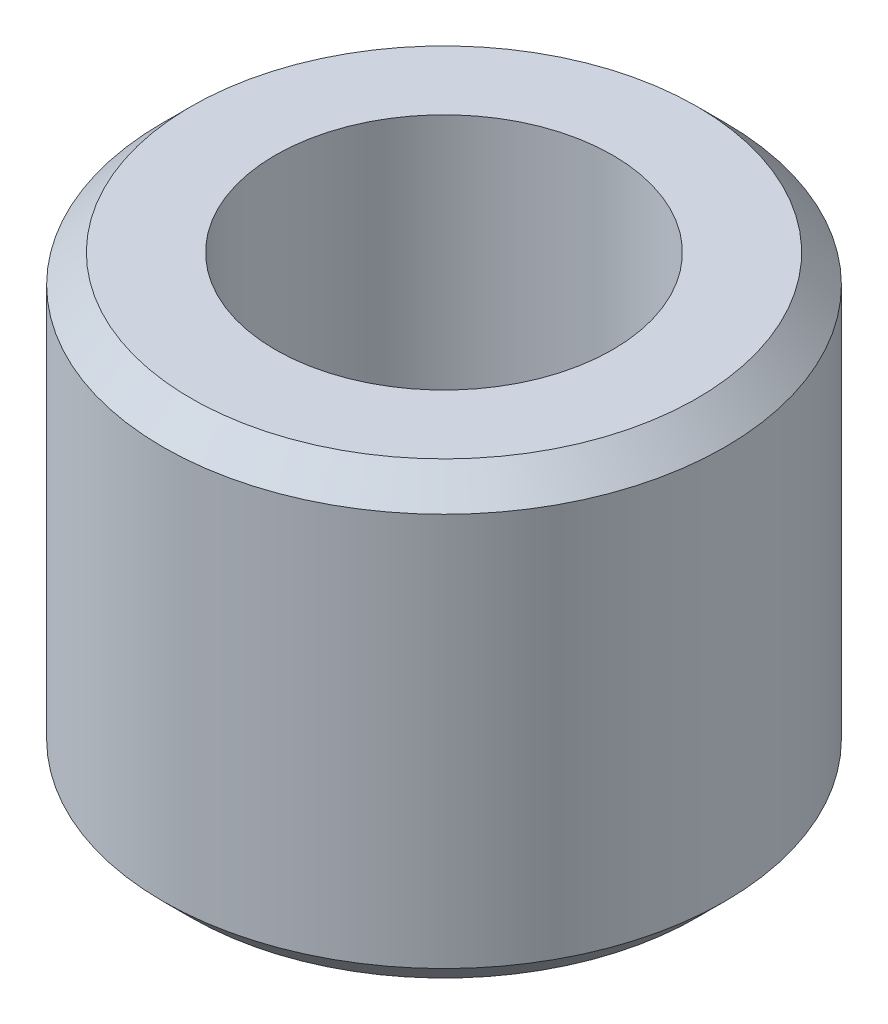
ISO-10303-21;
HEADER;
FILE_DESCRIPTION(('STEP AP214'),'2;1');
FILE_NAME('part.step','',(''),(''),'','','');
FILE_SCHEMA(('AUTOMOTIVE_DESIGN { 1 0 10303 214 1 1 1 1 }'));
ENDSEC;
DATA;
#1=APPLICATION_CONTEXT('core data for automotive mechanical design processes');
#2=APPLICATION_PROTOCOL_DEFINITION('international standard','automotive_design',2000,#1);
#3=PRODUCT_CONTEXT('',#1,'mechanical');
#4=PRODUCT('Part','Part','',(#3));
#5=PRODUCT_RELATED_PRODUCT_CATEGORY('part','',(#4));
#6=PRODUCT_DEFINITION_FORMATION('','',#4);
#7=PRODUCT_DEFINITION_CONTEXT('part definition',#1,'design');
#8=PRODUCT_DEFINITION('design','',#6,#7);
#9=PRODUCT_DEFINITION_SHAPE('','',#8);
#10=(LENGTH_UNIT() NAMED_UNIT(*) SI_UNIT(.MILLI.,.METRE.));
#11=(NAMED_UNIT(*) PLANE_ANGLE_UNIT() SI_UNIT($,.RADIAN.));
#12=(NAMED_UNIT(*) SI_UNIT($,.STERADIAN.) SOLID_ANGLE_UNIT());
#13=UNCERTAINTY_MEASURE_WITH_UNIT(LENGTH_MEASURE(1.E-05),#10,'distance_accuracy_value','');
#14=(GEOMETRIC_REPRESENTATION_CONTEXT(3) GLOBAL_UNCERTAINTY_ASSIGNED_CONTEXT((#13)) GLOBAL_UNIT_ASSIGNED_CONTEXT((#10,
#11,#12)) REPRESENTATION_CONTEXT('',''));
#15=CARTESIAN_POINT('',(0.,0.,0.));
#16=DIRECTION('',(0.,0.,1.));
#17=DIRECTION('',(1.,0.,0.));
#18=AXIS2_PLACEMENT_3D('',#15,#16,#17);
#19=CARTESIAN_POINT('',(-9.,-16.,9.));
#20=DIRECTION('',(0.,-1.,0.));
#21=DIRECTION('',(0.,0.,-1.));
#22=AXIS2_PLACEMENT_3D('',#19,#20,#21);
#23=PLANE('',#22);
#24=CARTESIAN_POINT('',(0.,-16.,0.));
#25=DIRECTION('',(0.,1.,0.));
#26=DIRECTION('',(0.,0.,1.));
#27=AXIS2_PLACEMENT_3D('',#24,#25,#26);
#28=CIRCLE('',#27,2.5);
#29=CARTESIAN_POINT('',(0.,-16.,2.5));
#30=VERTEX_POINT('',#29);
#31=EDGE_CURVE('E54',#30,#30,#28,.F.);
#32=ORIENTED_EDGE('',*,*,#31,.F.);
#33=EDGE_LOOP('',(#32));
#34=FACE_BOUND('',#33,.T.);
#35=CARTESIAN_POINT('',(0.,-16.,0.));
#36=DIRECTION('',(0.,1.,0.));
#37=DIRECTION('',(0.,0.,1.));
#38=AXIS2_PLACEMENT_3D('',#35,#36,#37);
#39=CIRCLE('',#38,9.);
#40=CARTESIAN_POINT('',(0.,-16.,9.));
#41=VERTEX_POINT('',#40);
#42=EDGE_CURVE('E58',#41,#41,#39,.F.);
#43=ORIENTED_EDGE('',*,*,#42,.T.);
#44=EDGE_LOOP('',(#43));
#45=FACE_BOUND('',#44,.T.);
#46=ADVANCED_FACE('F14',(#34,#45),#23,.T.);
#47=CARTESIAN_POINT('',(0.,-16.,0.));
#48=DIRECTION('',(0.,1.,0.));
#49=DIRECTION('',(0.,0.,1.));
#50=AXIS2_PLACEMENT_3D('',#47,#48,#49);
#51=CONICAL_SURFACE('',#50,9.,0.785398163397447);
#52=ORIENTED_EDGE('',*,*,#42,.F.);
#53=EDGE_LOOP('',(#52));
#54=FACE_BOUND('',#53,.T.);
#55=CARTESIAN_POINT('',(0.,-15.,0.));
#56=DIRECTION('',(0.,1.,0.));
#57=DIRECTION('',(0.,0.,1.));
#58=AXIS2_PLACEMENT_3D('',#55,#56,#57);
#59=CIRCLE('',#58,10.);
#60=CARTESIAN_POINT('',(0.,-15.,10.));
#61=VERTEX_POINT('',#60);
#62=EDGE_CURVE('E51',#61,#61,#59,.F.);
#63=ORIENTED_EDGE('',*,*,#62,.T.);
#64=EDGE_LOOP('',(#63));
#65=FACE_BOUND('',#64,.T.);
#66=ADVANCED_FACE('F65',(#54,#65),#51,.T.);
#67=CARTESIAN_POINT('',(0.,-16.,0.));
#68=DIRECTION('',(0.,1.,0.));
#69=DIRECTION('',(0.,0.,1.));
#70=AXIS2_PLACEMENT_3D('',#67,#68,#69);
#71=CYLINDRICAL_SURFACE('',#70,2.5);
#72=CARTESIAN_POINT('',(0.,-14.,0.));
#73=DIRECTION('',(0.,1.,0.));
#74=DIRECTION('',(0.,0.,1.));
#75=AXIS2_PLACEMENT_3D('',#72,#73,#74);
#76=CIRCLE('',#75,2.5);
#77=CARTESIAN_POINT('',(0.,-14.,2.5));
#78=VERTEX_POINT('',#77);
#79=EDGE_CURVE('E48',#78,#78,#76,.T.);
#80=ORIENTED_EDGE('',*,*,#79,.T.);
#81=EDGE_LOOP('',(#80));
#82=FACE_BOUND('',#81,.T.);
#83=ORIENTED_EDGE('',*,*,#31,.T.);
#84=EDGE_LOOP('',(#83));
#85=FACE_BOUND('',#84,.T.);
#86=ADVANCED_FACE('F68',(#82,#85),#71,.F.);
#87=CARTESIAN_POINT('',(0.,-15.,0.));
#88=DIRECTION('',(0.,1.,0.));
#89=DIRECTION('',(-1.,0.,0.));
#90=AXIS2_PLACEMENT_3D('',#87,#88,#89);
#91=CYLINDRICAL_SURFACE('',#90,10.);
#92=ORIENTED_EDGE('',*,*,#62,.F.);
#93=EDGE_LOOP('',(#92));
#94=FACE_BOUND('',#93,.T.);
#95=CARTESIAN_POINT('',(0.,-1.,0.));
#96=DIRECTION('',(0.,1.,0.));
#97=DIRECTION('',(0.,0.,1.));
#98=AXIS2_PLACEMENT_3D('',#95,#96,#97);
#99=CIRCLE('',#98,10.);
#100=CARTESIAN_POINT('',(0.,-1.,10.));
#101=VERTEX_POINT('',#100);
#102=EDGE_CURVE('E45',#101,#101,#99,.F.);
#103=ORIENTED_EDGE('',*,*,#102,.T.);
#104=EDGE_LOOP('',(#103));
#105=FACE_BOUND('',#104,.T.);
#106=ADVANCED_FACE('F80',(#94,#105),#91,.T.);
#107=CARTESIAN_POINT('',(-6.,-14.,6.));
#108=DIRECTION('',(0.,-1.,0.));
#109=DIRECTION('',(0.,0.,-1.));
#110=AXIS2_PLACEMENT_3D('',#107,#108,#109);
#111=PLANE('',#110);
#112=ORIENTED_EDGE('',*,*,#79,.F.);
#113=EDGE_LOOP('',(#112));
#114=FACE_BOUND('',#113,.T.);
#115=CARTESIAN_POINT('',(0.,-14.,0.));
#116=DIRECTION('',(0.,1.,0.));
#117=DIRECTION('',(-1.,0.,0.));
#118=AXIS2_PLACEMENT_3D('',#115,#116,#117);
#119=CIRCLE('',#118,6.);
#120=CARTESIAN_POINT('',(-6.,-14.,0.));
#121=VERTEX_POINT('',#120);
#122=EDGE_CURVE('E32',#121,#121,#119,.F.);
#123=ORIENTED_EDGE('',*,*,#122,.F.);
#124=EDGE_LOOP('',(#123));
#125=FACE_BOUND('',#124,.T.);
#126=ADVANCED_FACE('F86',(#114,#125),#111,.F.);
#127=CARTESIAN_POINT('',(0.,-1.,0.));
#128=DIRECTION('',(0.,-1.,0.));
#129=DIRECTION('',(0.,0.,-1.));
#130=AXIS2_PLACEMENT_3D('',#127,#128,#129);
#131=CONICAL_SURFACE('',#130,10.,0.785398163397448);
#132=ORIENTED_EDGE('',*,*,#102,.F.);
#133=EDGE_LOOP('',(#132));
#134=FACE_BOUND('',#133,.T.);
#135=CARTESIAN_POINT('',(0.,0.,0.));
#136=DIRECTION('',(0.,-1.,0.));
#137=DIRECTION('',(0.,0.,-1.));
#138=AXIS2_PLACEMENT_3D('',#135,#136,#137);
#139=CIRCLE('',#138,9.);
#140=CARTESIAN_POINT('',(0.,0.,-9.));
#141=VERTEX_POINT('',#140);
#142=EDGE_CURVE('E23',#141,#141,#139,.F.);
#143=ORIENTED_EDGE('',*,*,#142,.F.);
#144=EDGE_LOOP('',(#143));
#145=FACE_BOUND('',#144,.T.);
#146=ADVANCED_FACE('F82',(#134,#145),#131,.T.);
#147=CARTESIAN_POINT('',(0.,-14.,0.));
#148=DIRECTION('',(0.,1.,0.));
#149=DIRECTION('',(-1.,0.,0.));
#150=AXIS2_PLACEMENT_3D('',#147,#148,#149);
#151=CYLINDRICAL_SURFACE('',#150,6.);
#152=ORIENTED_EDGE('',*,*,#122,.T.);
#153=EDGE_LOOP('',(#152));
#154=FACE_BOUND('',#153,.T.);
#155=CARTESIAN_POINT('',(0.,0.,0.));
#156=DIRECTION('',(0.,1.,0.));
#157=DIRECTION('',(-1.,0.,0.));
#158=AXIS2_PLACEMENT_3D('',#155,#156,#157);
#159=CIRCLE('',#158,6.);
#160=CARTESIAN_POINT('',(-6.,0.,0.));
#161=VERTEX_POINT('',#160);
#162=EDGE_CURVE('E10',#161,#161,#159,.F.);
#163=ORIENTED_EDGE('',*,*,#162,.F.);
#164=EDGE_LOOP('',(#163));
#165=FACE_BOUND('',#164,.T.);
#166=ADVANCED_FACE('F85',(#154,#165),#151,.F.);
#167=CARTESIAN_POINT('',(-9.,0.,-9.));
#168=DIRECTION('',(0.,1.,0.));
#169=DIRECTION('',(0.,0.,1.));
#170=AXIS2_PLACEMENT_3D('',#167,#168,#169);
#171=PLANE('',#170);
#172=ORIENTED_EDGE('',*,*,#162,.T.);
#173=EDGE_LOOP('',(#172));
#174=FACE_BOUND('',#173,.T.);
#175=ORIENTED_EDGE('',*,*,#142,.T.);
#176=EDGE_LOOP('',(#175));
#177=FACE_BOUND('',#176,.T.);
#178=ADVANCED_FACE('F16',(#174,#177),#171,.T.);
#179=CLOSED_SHELL('',(#46,#66,#86,#106,#126,#146,#166,#178));
#180=MANIFOLD_SOLID_BREP('B1',#179);
#181=ADVANCED_BREP_SHAPE_REPRESENTATION('',(#18,#180),#14);
#182=SHAPE_DEFINITION_REPRESENTATION(#9,#181);
ENDSEC;
END-ISO-10303-21;
